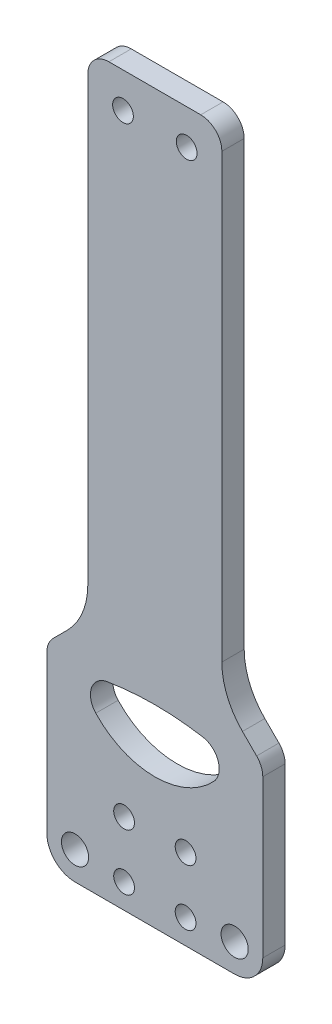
from build123d import *

# Parameters (mm, degrees)
SKETCH2_R           = 1.4732
SKETCH2_R_2         = 1.9304
BOSS_EXTRUDE1_DEPTH = 3.175
FILLET1_R           = 3
FILLET2_R           = 10
FILLET3_R           = 4


with BuildPart() as part:
    # Sketch2 → Boss-Extrude1 (new body)
    with BuildSketch(Plane.XY):
        Polygon((-15.34314575, 13.5), (15.34314575, 13.5), (15.34314575, 41.040737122), (9.525, 46.858882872), (9.525, 116.858882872), (-9.525, 116.858882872), (-9.525, 46.858882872), (-15.34314575, 41.040737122), align=None)
        with Locations((4.3688, 17)):
            Circle(SKETCH2_R, mode=Mode.SUBTRACT)
        with Locations((4.3688, 25)):
            Circle(SKETCH2_R, mode=Mode.SUBTRACT)
        with Locations((-4.3688, 25)):
            Circle(SKETCH2_R, mode=Mode.SUBTRACT)
        with Locations((-4.3688, 17)):
            Circle(SKETCH2_R, mode=Mode.SUBTRACT)
        with Locations((-4.525, 111.858882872)):
            Circle(SKETCH2_R, mode=Mode.SUBTRACT)
        with Locations(Location((4.525, 111.858882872, 0), (0, 0, 180))):
            Circle(SKETCH2_R, mode=Mode.SUBTRACT)
        with Locations((-11.34314575, 17.5)):
            Circle(SKETCH2_R_2, mode=Mode.SUBTRACT)
        with Locations(Location((11.34314575, 17.5, 0), (0, 0, 180))):
            Circle(SKETCH2_R_2, mode=Mode.SUBTRACT)
        with BuildLine():
            ThreePointArc((8.392748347, 35.753533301), (9.003125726, 38.563464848), (6.815445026, 40.42956479))
            ThreePointArc((6.815445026, 40.42956479), (0, 41), (-6.815445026, 40.42956479))
            ThreePointArc((-6.815445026, 40.42956479), (-9.003125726, 38.563464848), (-8.392748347, 35.753533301))
            ThreePointArc((-8.392748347, 35.753533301), (0, 32.117411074), (8.392748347, 35.753533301))
        make_face(mode=Mode.SUBTRACT)
    extrude(amount=BOSS_EXTRUDE1_DEPTH)

    # Fillet1
    fillet1_edges = [part.edges().sort_by_distance(p)[0] for p in [
        (-15.34314575, 41.040737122, 1.5875),
        (-9.525, 116.858882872, 1.5875),
        (9.525, 116.858882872, 1.5875),
        (15.34314575, 41.040737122, 1.5875),
    ]]
    fillet(fillet1_edges, radius=FILLET1_R)

    # Fillet2
    fillet2_edges = [part.edges().sort_by_distance(p)[0] for p in [
        (-9.525, 46.858882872, 1.5875),
        (9.525, 46.858882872, 1.5875),
    ]]
    fillet(fillet2_edges, radius=FILLET2_R)

    # Fillet3
    fillet3_edges = [part.edges().sort_by_distance(p)[0] for p in [
        (15.34314575, 13.5, 1.5875),
        (-15.34314575, 13.5, 1.5875),
    ]]
    fillet(fillet3_edges, radius=FILLET3_R)


solid = part.part
